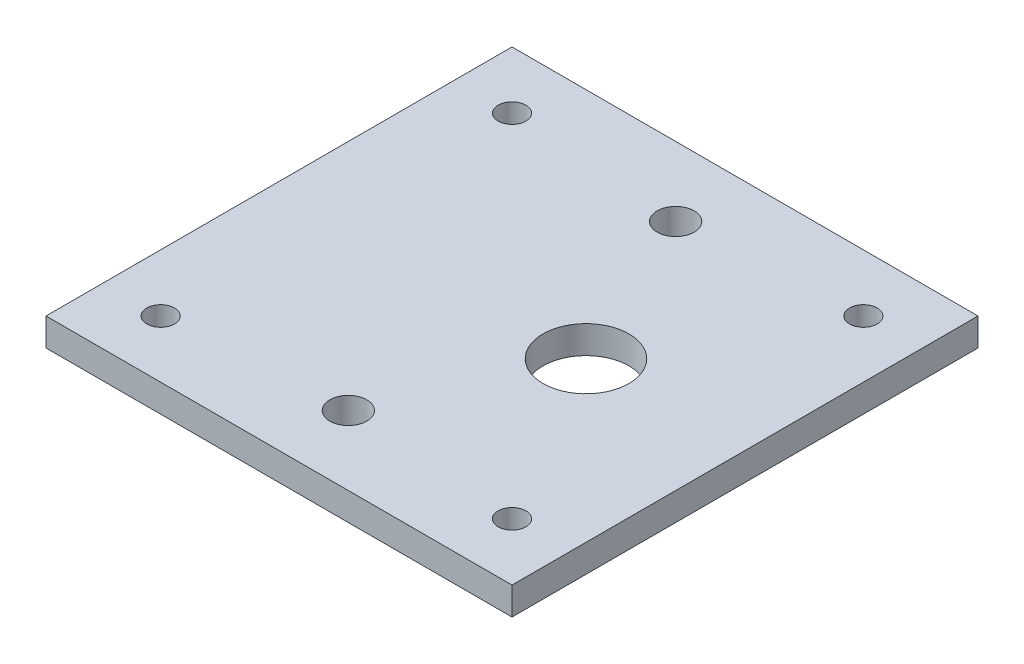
from build123d import *

# Parameters (mm, degrees)
SKETCH_2_W               = 50.4
SKETCH_2_H               = 50.4
EXTRUDE_1_DEPTH          = 3
CUT_EXTRUDE_1_DEPTH      = 36.764227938
CUT_EXTRUDE_1_DEPTH_BACK = 36.764227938
SKETCH_3_R               = 2
SKETCH_4_R               = 1.5
SKETCH_4_R_2             = 4.65
CUT_EXTRUDE_2_DEPTH      = 3


with BuildPart() as part:
    # Sketch 2 → Extrude 1 (new body)
    with BuildSketch(Plane(origin=(0, 0, 0), x_dir=(1, 0, 0), z_dir=(0, 1, 0))):
        Rectangle(SKETCH_2_W, SKETCH_2_H)
    extrude(amount=-EXTRUDE_1_DEPTH)

    # Sketch 3 → Cut-Extrude 1 (cut, two sides: drawn at the far end of the back side and taken through both)
    with BuildSketch(Plane(origin=(0, 0, 0), x_dir=(1, 0, 0), z_dir=(0, 1, 0)).offset(-CUT_EXTRUDE_1_DEPTH_BACK)):
        with Locations(Location((0, 17.7, 0), (0, 0, 270))):
            Circle(SKETCH_3_R)
        with Locations(Location((0, -17.7, 0), (0, 0, 270))):
            Circle(SKETCH_3_R)
    extrude(amount=CUT_EXTRUDE_1_DEPTH + CUT_EXTRUDE_1_DEPTH_BACK, mode=Mode.SUBTRACT)

    # Sketch 4 → Cut-Extrude 2 (cut)
    with BuildSketch(Plane(origin=(0, 0, 0), x_dir=(1, 0, 0), z_dir=(0, 1, 0))):
        with Locations(Location((-19, 19, 0), (0, 0, 270))):
            Circle(SKETCH_4_R)
        with Locations(Location((19, 19, 0), (0, 0, 270))):
            Circle(SKETCH_4_R)
        with Locations(Location((19, -19, 0), (0, 0, 270))):
            Circle(SKETCH_4_R)
        with Locations(Location((-19, -19, 0), (0, 0, 270))):
            Circle(SKETCH_4_R)
        with Locations(Location((8, 0, 0), (0, 0, 270))):
            Circle(SKETCH_4_R_2)
    extrude(amount=-CUT_EXTRUDE_2_DEPTH, mode=Mode.SUBTRACT)


solid = part.part
